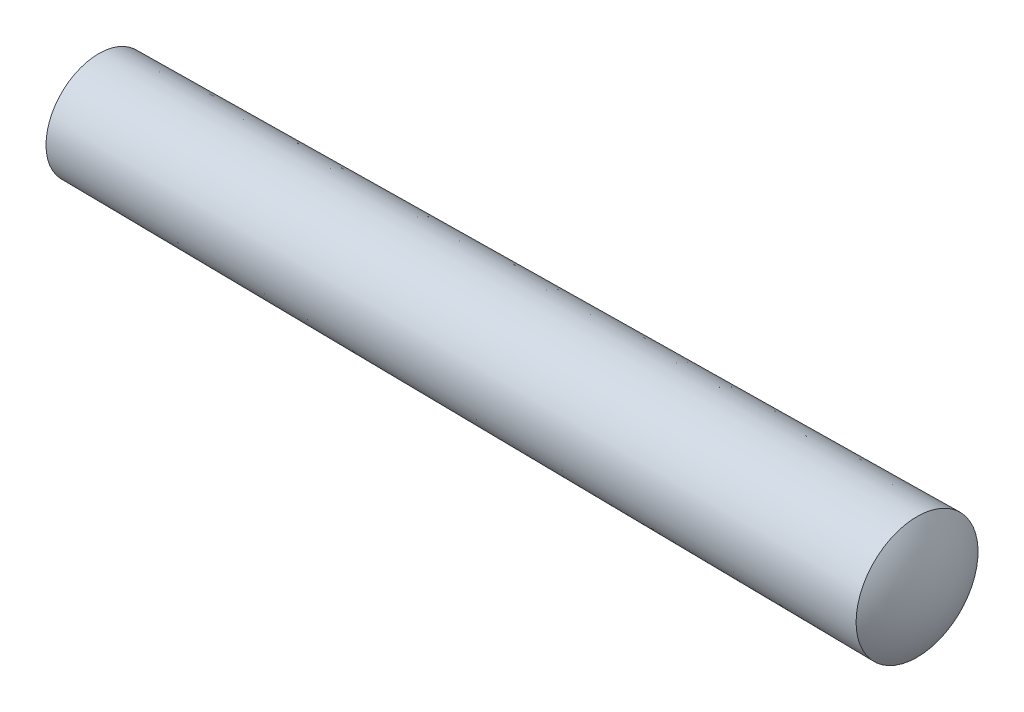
from build123d import *


with BuildPart() as part:
    # BodySke → Body (revolve)
    with BuildSketch(Plane.XY, mode=Mode.PRIVATE) as body_sk:
        with BuildLine():
            Line((0, 2.5), (38.74, 2.8874))
            ThreePointArc((38.74, 2.8874), (39.422958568, 1.514905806), (39.65797584, 0))
            Line((39.65797584, 0), (-0.669872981, 0))
            ThreePointArc((-0.669872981, 0), (-0.499502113, 1.294095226), (0, 2.5))
        make_face()
    revolve(body_sk.sketch.rotate(Axis((-0.669872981, 0, 0), (1, 0, 0)), 90), axis=Axis((-0.669872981, 0, 0), (1, 0, 0)))


solid = part.part
